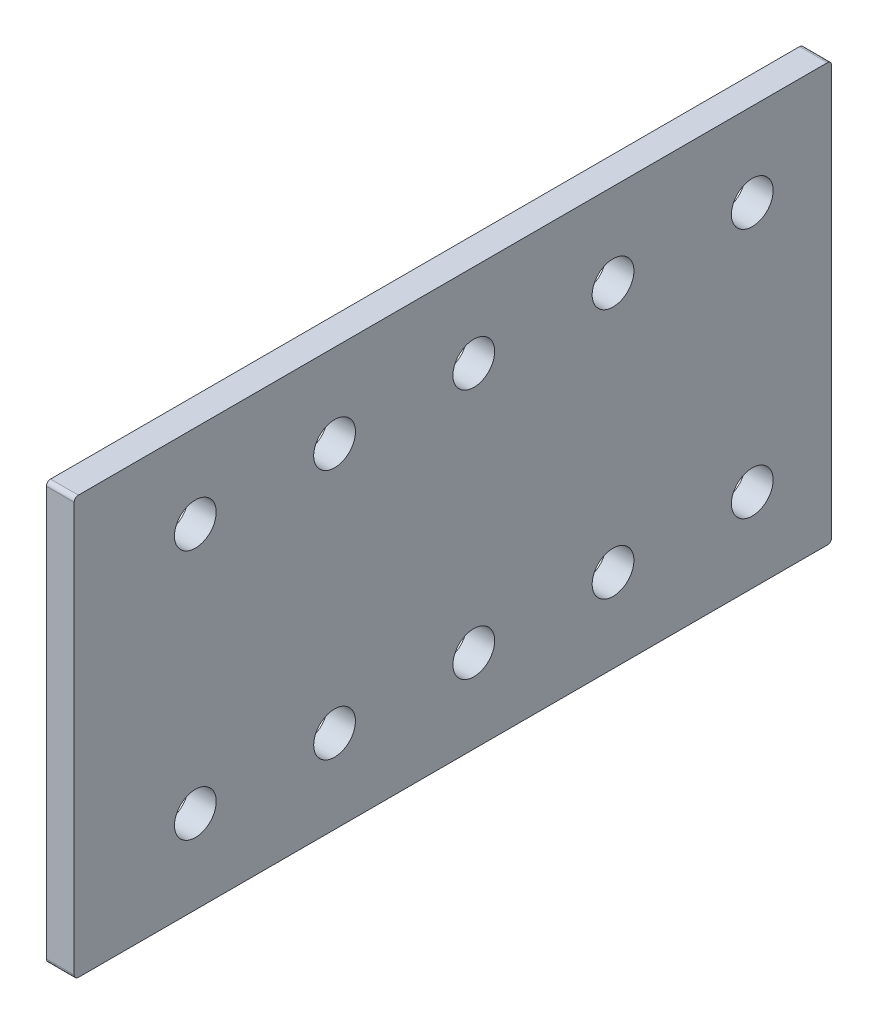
ISO-10303-21;
HEADER;
FILE_DESCRIPTION(('STEP AP214'),'2;1');
FILE_NAME('part.step','',(''),(''),'','','');
FILE_SCHEMA(('AUTOMOTIVE_DESIGN { 1 0 10303 214 1 1 1 1 }'));
ENDSEC;
DATA;
#1=APPLICATION_CONTEXT('core data for automotive mechanical design processes');
#2=APPLICATION_PROTOCOL_DEFINITION('international standard','automotive_design',2000,#1);
#3=PRODUCT_CONTEXT('',#1,'mechanical');
#4=PRODUCT('Part','Part','',(#3));
#5=PRODUCT_RELATED_PRODUCT_CATEGORY('part','',(#4));
#6=PRODUCT_DEFINITION_FORMATION('','',#4);
#7=PRODUCT_DEFINITION_CONTEXT('part definition',#1,'design');
#8=PRODUCT_DEFINITION('design','',#6,#7);
#9=PRODUCT_DEFINITION_SHAPE('','',#8);
#10=(LENGTH_UNIT() NAMED_UNIT(*) SI_UNIT(.MILLI.,.METRE.));
#11=(NAMED_UNIT(*) PLANE_ANGLE_UNIT() SI_UNIT($,.RADIAN.));
#12=(NAMED_UNIT(*) SI_UNIT($,.STERADIAN.) SOLID_ANGLE_UNIT());
#13=UNCERTAINTY_MEASURE_WITH_UNIT(LENGTH_MEASURE(1.E-05),#10,'distance_accuracy_value','');
#14=(GEOMETRIC_REPRESENTATION_CONTEXT(3) GLOBAL_UNCERTAINTY_ASSIGNED_CONTEXT((#13)) GLOBAL_UNIT_ASSIGNED_CONTEXT((#10,
#11,#12)) REPRESENTATION_CONTEXT('',''));
#15=CARTESIAN_POINT('',(0.,0.,0.));
#16=DIRECTION('',(0.,0.,1.));
#17=DIRECTION('',(1.,0.,0.));
#18=AXIS2_PLACEMENT_3D('',#15,#16,#17);
#19=CARTESIAN_POINT('',(-20.,0.,0.));
#20=DIRECTION('',(1.,0.,0.));
#21=DIRECTION('',(0.,0.,-1.));
#22=AXIS2_PLACEMENT_3D('',#19,#20,#21);
#23=PLANE('',#22);
#24=DIRECTION('',(0.,1.,0.));
#25=VECTOR('',#24,1.);
#26=CARTESIAN_POINT('',(-20.,-150.,281.000000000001));
#27=LINE('',#26,#25);
#28=CARTESIAN_POINT('',(-20.,-147.,281.000000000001));
#29=VERTEX_POINT('',#28);
#30=CARTESIAN_POINT('',(-20.,147.,281.000000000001));
#31=VERTEX_POINT('',#30);
#32=EDGE_CURVE('E174',#29,#31,#27,.T.);
#33=ORIENTED_EDGE('',*,*,#32,.T.);
#34=CARTESIAN_POINT('',(-20.,147.,278.));
#35=DIRECTION('',(1.,0.,0.));
#36=DIRECTION('',(0.,0.,-1.));
#37=AXIS2_PLACEMENT_3D('',#34,#35,#36);
#38=CIRCLE('',#37,3.);
#39=CARTESIAN_POINT('',(-20.,150.,278.));
#40=VERTEX_POINT('',#39);
#41=EDGE_CURVE('E151',#31,#40,#38,.F.);
#42=ORIENTED_EDGE('',*,*,#41,.T.);
#43=DIRECTION('',(0.,0.,-1.));
#44=VECTOR('',#43,1.);
#45=CARTESIAN_POINT('',(-20.,150.,-262.999999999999));
#46=LINE('',#45,#44);
#47=CARTESIAN_POINT('',(-20.,150.,-260.));
#48=VERTEX_POINT('',#47);
#49=EDGE_CURVE('E122',#40,#48,#46,.T.);
#50=ORIENTED_EDGE('',*,*,#49,.T.);
#51=CARTESIAN_POINT('',(-20.,147.,-260.));
#52=DIRECTION('',(1.,0.,0.));
#53=DIRECTION('',(0.,0.,-1.));
#54=AXIS2_PLACEMENT_3D('',#51,#52,#53);
#55=CIRCLE('',#54,3.);
#56=CARTESIAN_POINT('',(-20.,147.,-262.999999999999));
#57=VERTEX_POINT('',#56);
#58=EDGE_CURVE('E146',#48,#57,#55,.F.);
#59=ORIENTED_EDGE('',*,*,#58,.T.);
#60=DIRECTION('',(0.,-1.,0.));
#61=VECTOR('',#60,1.);
#62=CARTESIAN_POINT('',(-20.,-150.,-263.));
#63=LINE('',#62,#61);
#64=CARTESIAN_POINT('',(-20.,-147.,-263.));
#65=VERTEX_POINT('',#64);
#66=EDGE_CURVE('E129',#57,#65,#63,.T.);
#67=ORIENTED_EDGE('',*,*,#66,.T.);
#68=CARTESIAN_POINT('',(-20.,-147.,-260.));
#69=DIRECTION('',(1.,0.,0.));
#70=DIRECTION('',(0.,0.,-1.));
#71=AXIS2_PLACEMENT_3D('',#68,#69,#70);
#72=CIRCLE('',#71,3.);
#73=CARTESIAN_POINT('',(-20.,-150.,-260.));
#74=VERTEX_POINT('',#73);
#75=EDGE_CURVE('E58',#65,#74,#72,.F.);
#76=ORIENTED_EDGE('',*,*,#75,.T.);
#77=DIRECTION('',(0.,0.,1.));
#78=VECTOR('',#77,1.);
#79=CARTESIAN_POINT('',(-20.,-150.,-263.));
#80=LINE('',#79,#78);
#81=CARTESIAN_POINT('',(-20.,-150.,278.));
#82=VERTEX_POINT('',#81);
#83=EDGE_CURVE('E132',#74,#82,#80,.T.);
#84=ORIENTED_EDGE('',*,*,#83,.T.);
#85=CARTESIAN_POINT('',(-20.,-147.,278.));
#86=DIRECTION('',(1.,0.,0.));
#87=DIRECTION('',(0.,0.,-1.));
#88=AXIS2_PLACEMENT_3D('',#85,#86,#87);
#89=CIRCLE('',#88,3.);
#90=EDGE_CURVE('E149',#82,#29,#89,.F.);
#91=ORIENTED_EDGE('',*,*,#90,.T.);
#92=EDGE_LOOP('',(#33,#42,#50,#59,#67,#76,#84,#91));
#93=FACE_BOUND('',#92,.T.);
#94=CARTESIAN_POINT('',(-20.,-90.0000000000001,-106.));
#95=DIRECTION('',(-1.,0.,0.));
#96=DIRECTION('',(0.,0.,1.));
#97=AXIS2_PLACEMENT_3D('',#94,#95,#96);
#98=CIRCLE('',#97,15.);
#99=CARTESIAN_POINT('',(-20.,-90.0000000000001,-90.9999999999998));
#100=VERTEX_POINT('',#99);
#101=EDGE_CURVE('E167',#100,#100,#98,.T.);
#102=ORIENTED_EDGE('',*,*,#101,.F.);
#103=EDGE_LOOP('',(#102));
#104=FACE_BOUND('',#103,.T.);
#105=CARTESIAN_POINT('',(-20.,90.,-105.999999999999));
#106=DIRECTION('',(-1.,0.,0.));
#107=DIRECTION('',(0.,0.,-1.));
#108=AXIS2_PLACEMENT_3D('',#105,#106,#107);
#109=CIRCLE('',#108,15.);
#110=CARTESIAN_POINT('',(-20.,90.,-120.999999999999));
#111=VERTEX_POINT('',#110);
#112=EDGE_CURVE('E179',#111,#111,#109,.T.);
#113=ORIENTED_EDGE('',*,*,#112,.F.);
#114=EDGE_LOOP('',(#113));
#115=FACE_BOUND('',#114,.T.);
#116=CARTESIAN_POINT('',(-20.,-90.0000000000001,-206.));
#117=DIRECTION('',(-1.,0.,0.));
#118=DIRECTION('',(0.,0.,1.));
#119=AXIS2_PLACEMENT_3D('',#116,#117,#118);
#120=CIRCLE('',#119,15.);
#121=CARTESIAN_POINT('',(-20.,-90.0000000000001,-191.));
#122=VERTEX_POINT('',#121);
#123=EDGE_CURVE('E184',#122,#122,#120,.T.);
#124=ORIENTED_EDGE('',*,*,#123,.F.);
#125=EDGE_LOOP('',(#124));
#126=FACE_BOUND('',#125,.T.);
#127=CARTESIAN_POINT('',(-20.,-90.0000000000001,-5.99999999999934));
#128=DIRECTION('',(-1.,0.,0.));
#129=DIRECTION('',(0.,0.,1.));
#130=AXIS2_PLACEMENT_3D('',#127,#128,#129);
#131=CIRCLE('',#130,15.);
#132=CARTESIAN_POINT('',(-20.,-90.0000000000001,9.00000000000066));
#133=VERTEX_POINT('',#132);
#134=EDGE_CURVE('E190',#133,#133,#131,.T.);
#135=ORIENTED_EDGE('',*,*,#134,.F.);
#136=EDGE_LOOP('',(#135));
#137=FACE_BOUND('',#136,.T.);
#138=CARTESIAN_POINT('',(-20.,90.,-206.));
#139=DIRECTION('',(-1.,0.,0.));
#140=DIRECTION('',(0.,0.,-1.));
#141=AXIS2_PLACEMENT_3D('',#138,#139,#140);
#142=CIRCLE('',#141,15.);
#143=CARTESIAN_POINT('',(-20.,90.,-221.));
#144=VERTEX_POINT('',#143);
#145=EDGE_CURVE('E196',#144,#144,#142,.T.);
#146=ORIENTED_EDGE('',*,*,#145,.F.);
#147=EDGE_LOOP('',(#146));
#148=FACE_BOUND('',#147,.T.);
#149=CARTESIAN_POINT('',(-20.,-90.,194.));
#150=DIRECTION('',(-1.,0.,0.));
#151=DIRECTION('',(0.,0.,1.));
#152=AXIS2_PLACEMENT_3D('',#149,#150,#151);
#153=CIRCLE('',#152,15.);
#154=CARTESIAN_POINT('',(-20.,-90.,209.));
#155=VERTEX_POINT('',#154);
#156=EDGE_CURVE('E202',#155,#155,#153,.T.);
#157=ORIENTED_EDGE('',*,*,#156,.F.);
#158=EDGE_LOOP('',(#157));
#159=FACE_BOUND('',#158,.T.);
#160=CARTESIAN_POINT('',(-20.,-90.0000000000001,94.0000000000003));
#161=DIRECTION('',(-1.,0.,0.));
#162=DIRECTION('',(0.,0.,1.));
#163=AXIS2_PLACEMENT_3D('',#160,#161,#162);
#164=CIRCLE('',#163,15.);
#165=CARTESIAN_POINT('',(-20.,-90.0000000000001,109.));
#166=VERTEX_POINT('',#165);
#167=EDGE_CURVE('E208',#166,#166,#164,.T.);
#168=ORIENTED_EDGE('',*,*,#167,.F.);
#169=EDGE_LOOP('',(#168));
#170=FACE_BOUND('',#169,.T.);
#171=CARTESIAN_POINT('',(-20.,90.,94.0000000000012));
#172=DIRECTION('',(-1.,0.,0.));
#173=DIRECTION('',(0.,0.,-1.));
#174=AXIS2_PLACEMENT_3D('',#171,#172,#173);
#175=CIRCLE('',#174,15.);
#176=CARTESIAN_POINT('',(-20.,90.,79.0000000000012));
#177=VERTEX_POINT('',#176);
#178=EDGE_CURVE('E214',#177,#177,#175,.T.);
#179=ORIENTED_EDGE('',*,*,#178,.F.);
#180=EDGE_LOOP('',(#179));
#181=FACE_BOUND('',#180,.T.);
#182=CARTESIAN_POINT('',(-20.,90.,194.000000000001));
#183=DIRECTION('',(-1.,0.,0.));
#184=DIRECTION('',(0.,0.,-1.));
#185=AXIS2_PLACEMENT_3D('',#182,#183,#184);
#186=CIRCLE('',#185,15.);
#187=CARTESIAN_POINT('',(-20.,90.,179.000000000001));
#188=VERTEX_POINT('',#187);
#189=EDGE_CURVE('E220',#188,#188,#186,.T.);
#190=ORIENTED_EDGE('',*,*,#189,.F.);
#191=EDGE_LOOP('',(#190));
#192=FACE_BOUND('',#191,.T.);
#193=CARTESIAN_POINT('',(-20.,90.,-5.99999999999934));
#194=DIRECTION('',(-1.,0.,0.));
#195=DIRECTION('',(0.,0.,-1.));
#196=AXIS2_PLACEMENT_3D('',#193,#194,#195);
#197=CIRCLE('',#196,15.);
#198=CARTESIAN_POINT('',(-20.,90.,-20.9999999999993));
#199=VERTEX_POINT('',#198);
#200=EDGE_CURVE('E226',#199,#199,#197,.T.);
#201=ORIENTED_EDGE('',*,*,#200,.F.);
#202=EDGE_LOOP('',(#201));
#203=FACE_BOUND('',#202,.T.);
#204=ADVANCED_FACE('F36',(#93,#104,#115,#126,#137,#148,#159,#170,#181,#192,#203),#23,.F.);
#205=CARTESIAN_POINT('',(0.,0.,0.));
#206=DIRECTION('',(1.,0.,0.));
#207=DIRECTION('',(0.,0.,-1.));
#208=AXIS2_PLACEMENT_3D('',#205,#206,#207);
#209=PLANE('',#208);
#210=CARTESIAN_POINT('',(0.,90.,194.000000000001));
#211=DIRECTION('',(-1.,0.,0.));
#212=DIRECTION('',(0.,0.,-1.));
#213=AXIS2_PLACEMENT_3D('',#210,#211,#212);
#214=CIRCLE('',#213,15.);
#215=CARTESIAN_POINT('',(0.,90.,179.000000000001));
#216=VERTEX_POINT('',#215);
#217=EDGE_CURVE('E223',#216,#216,#214,.T.);
#218=ORIENTED_EDGE('',*,*,#217,.T.);
#219=EDGE_LOOP('',(#218));
#220=FACE_BOUND('',#219,.T.);
#221=CARTESIAN_POINT('',(0.,-90.0000000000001,94.0000000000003));
#222=DIRECTION('',(-1.,0.,0.));
#223=DIRECTION('',(0.,0.,1.));
#224=AXIS2_PLACEMENT_3D('',#221,#222,#223);
#225=CIRCLE('',#224,15.);
#226=CARTESIAN_POINT('',(0.,-90.0000000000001,109.));
#227=VERTEX_POINT('',#226);
#228=EDGE_CURVE('E211',#227,#227,#225,.T.);
#229=ORIENTED_EDGE('',*,*,#228,.T.);
#230=EDGE_LOOP('',(#229));
#231=FACE_BOUND('',#230,.T.);
#232=CARTESIAN_POINT('',(0.,90.,-206.));
#233=DIRECTION('',(-1.,0.,0.));
#234=DIRECTION('',(0.,0.,-1.));
#235=AXIS2_PLACEMENT_3D('',#232,#233,#234);
#236=CIRCLE('',#235,15.);
#237=CARTESIAN_POINT('',(0.,90.,-221.));
#238=VERTEX_POINT('',#237);
#239=EDGE_CURVE('E199',#238,#238,#236,.T.);
#240=ORIENTED_EDGE('',*,*,#239,.T.);
#241=EDGE_LOOP('',(#240));
#242=FACE_BOUND('',#241,.T.);
#243=CARTESIAN_POINT('',(0.,-90.0000000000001,-206.));
#244=DIRECTION('',(-1.,0.,0.));
#245=DIRECTION('',(0.,0.,1.));
#246=AXIS2_PLACEMENT_3D('',#243,#244,#245);
#247=CIRCLE('',#246,15.);
#248=CARTESIAN_POINT('',(0.,-90.0000000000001,-191.));
#249=VERTEX_POINT('',#248);
#250=EDGE_CURVE('E187',#249,#249,#247,.T.);
#251=ORIENTED_EDGE('',*,*,#250,.T.);
#252=EDGE_LOOP('',(#251));
#253=FACE_BOUND('',#252,.T.);
#254=CARTESIAN_POINT('',(0.,-90.0000000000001,-106.));
#255=DIRECTION('',(-1.,0.,0.));
#256=DIRECTION('',(0.,0.,1.));
#257=AXIS2_PLACEMENT_3D('',#254,#255,#256);
#258=CIRCLE('',#257,15.);
#259=CARTESIAN_POINT('',(0.,-90.0000000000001,-90.9999999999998));
#260=VERTEX_POINT('',#259);
#261=EDGE_CURVE('E170',#260,#260,#258,.T.);
#262=ORIENTED_EDGE('',*,*,#261,.T.);
#263=EDGE_LOOP('',(#262));
#264=FACE_BOUND('',#263,.T.);
#265=DIRECTION('',(0.,0.,-1.));
#266=VECTOR('',#265,1.);
#267=CARTESIAN_POINT('',(0.,150.,-262.999999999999));
#268=LINE('',#267,#266);
#269=CARTESIAN_POINT('',(0.,150.,278.));
#270=VERTEX_POINT('',#269);
#271=CARTESIAN_POINT('',(0.,150.,-260.));
#272=VERTEX_POINT('',#271);
#273=EDGE_CURVE('E119',#270,#272,#268,.T.);
#274=ORIENTED_EDGE('',*,*,#273,.F.);
#275=CARTESIAN_POINT('',(0.,147.,278.));
#276=DIRECTION('',(1.,0.,0.));
#277=DIRECTION('',(0.,0.,-1.));
#278=AXIS2_PLACEMENT_3D('',#275,#276,#277);
#279=CIRCLE('',#278,3.);
#280=CARTESIAN_POINT('',(0.,147.,281.000000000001));
#281=VERTEX_POINT('',#280);
#282=EDGE_CURVE('E102',#270,#281,#279,.T.);
#283=ORIENTED_EDGE('',*,*,#282,.T.);
#284=DIRECTION('',(0.,1.,0.));
#285=VECTOR('',#284,1.);
#286=CARTESIAN_POINT('',(0.,-150.,281.000000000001));
#287=LINE('',#286,#285);
#288=CARTESIAN_POINT('',(0.,-147.,281.000000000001));
#289=VERTEX_POINT('',#288);
#290=EDGE_CURVE('E130',#289,#281,#287,.T.);
#291=ORIENTED_EDGE('',*,*,#290,.F.);
#292=CARTESIAN_POINT('',(0.,-147.,278.));
#293=DIRECTION('',(1.,0.,0.));
#294=DIRECTION('',(0.,0.,-1.));
#295=AXIS2_PLACEMENT_3D('',#292,#293,#294);
#296=CIRCLE('',#295,3.);
#297=CARTESIAN_POINT('',(0.,-150.,278.));
#298=VERTEX_POINT('',#297);
#299=EDGE_CURVE('E113',#289,#298,#296,.T.);
#300=ORIENTED_EDGE('',*,*,#299,.T.);
#301=DIRECTION('',(0.,0.,1.));
#302=VECTOR('',#301,1.);
#303=CARTESIAN_POINT('',(0.,-150.,-263.));
#304=LINE('',#303,#302);
#305=CARTESIAN_POINT('',(0.,-150.,-260.));
#306=VERTEX_POINT('',#305);
#307=EDGE_CURVE('E134',#306,#298,#304,.T.);
#308=ORIENTED_EDGE('',*,*,#307,.F.);
#309=CARTESIAN_POINT('',(0.,-147.,-260.));
#310=DIRECTION('',(1.,0.,0.));
#311=DIRECTION('',(0.,0.,-1.));
#312=AXIS2_PLACEMENT_3D('',#309,#310,#311);
#313=CIRCLE('',#312,3.);
#314=CARTESIAN_POINT('',(0.,-147.,-263.));
#315=VERTEX_POINT('',#314);
#316=EDGE_CURVE('E140',#306,#315,#313,.T.);
#317=ORIENTED_EDGE('',*,*,#316,.T.);
#318=DIRECTION('',(0.,-1.,0.));
#319=VECTOR('',#318,1.);
#320=CARTESIAN_POINT('',(0.,-150.,-263.));
#321=LINE('',#320,#319);
#322=CARTESIAN_POINT('',(0.,147.,-262.999999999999));
#323=VERTEX_POINT('',#322);
#324=EDGE_CURVE('E162',#323,#315,#321,.T.);
#325=ORIENTED_EDGE('',*,*,#324,.F.);
#326=CARTESIAN_POINT('',(0.,147.,-260.));
#327=DIRECTION('',(1.,0.,0.));
#328=DIRECTION('',(0.,0.,-1.));
#329=AXIS2_PLACEMENT_3D('',#326,#327,#328);
#330=CIRCLE('',#329,3.);
#331=EDGE_CURVE('E123',#323,#272,#330,.T.);
#332=ORIENTED_EDGE('',*,*,#331,.T.);
#333=EDGE_LOOP('',(#274,#283,#291,#300,#308,#317,#325,#332));
#334=FACE_BOUND('',#333,.T.);
#335=CARTESIAN_POINT('',(0.,90.,-105.999999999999));
#336=DIRECTION('',(-1.,0.,0.));
#337=DIRECTION('',(0.,0.,-1.));
#338=AXIS2_PLACEMENT_3D('',#335,#336,#337);
#339=CIRCLE('',#338,15.);
#340=CARTESIAN_POINT('',(0.,90.,-120.999999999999));
#341=VERTEX_POINT('',#340);
#342=EDGE_CURVE('E181',#341,#341,#339,.T.);
#343=ORIENTED_EDGE('',*,*,#342,.T.);
#344=EDGE_LOOP('',(#343));
#345=FACE_BOUND('',#344,.T.);
#346=CARTESIAN_POINT('',(0.,-90.0000000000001,-5.99999999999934));
#347=DIRECTION('',(-1.,0.,0.));
#348=DIRECTION('',(0.,0.,1.));
#349=AXIS2_PLACEMENT_3D('',#346,#347,#348);
#350=CIRCLE('',#349,15.);
#351=CARTESIAN_POINT('',(0.,-90.0000000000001,9.00000000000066));
#352=VERTEX_POINT('',#351);
#353=EDGE_CURVE('E193',#352,#352,#350,.T.);
#354=ORIENTED_EDGE('',*,*,#353,.T.);
#355=EDGE_LOOP('',(#354));
#356=FACE_BOUND('',#355,.T.);
#357=CARTESIAN_POINT('',(0.,-90.0000000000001,194.));
#358=DIRECTION('',(-1.,0.,0.));
#359=DIRECTION('',(0.,0.,1.));
#360=AXIS2_PLACEMENT_3D('',#357,#358,#359);
#361=CIRCLE('',#360,15.);
#362=CARTESIAN_POINT('',(0.,-90.0000000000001,209.));
#363=VERTEX_POINT('',#362);
#364=EDGE_CURVE('E205',#363,#363,#361,.T.);
#365=ORIENTED_EDGE('',*,*,#364,.T.);
#366=EDGE_LOOP('',(#365));
#367=FACE_BOUND('',#366,.T.);
#368=CARTESIAN_POINT('',(0.,90.,94.0000000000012));
#369=DIRECTION('',(-1.,0.,0.));
#370=DIRECTION('',(0.,0.,-1.));
#371=AXIS2_PLACEMENT_3D('',#368,#369,#370);
#372=CIRCLE('',#371,15.);
#373=CARTESIAN_POINT('',(0.,90.,79.0000000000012));
#374=VERTEX_POINT('',#373);
#375=EDGE_CURVE('E217',#374,#374,#372,.T.);
#376=ORIENTED_EDGE('',*,*,#375,.T.);
#377=EDGE_LOOP('',(#376));
#378=FACE_BOUND('',#377,.T.);
#379=CARTESIAN_POINT('',(0.,90.,-5.99999999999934));
#380=DIRECTION('',(-1.,0.,0.));
#381=DIRECTION('',(0.,0.,-1.));
#382=AXIS2_PLACEMENT_3D('',#379,#380,#381);
#383=CIRCLE('',#382,15.);
#384=CARTESIAN_POINT('',(0.,90.,-20.9999999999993));
#385=VERTEX_POINT('',#384);
#386=EDGE_CURVE('E229',#385,#385,#383,.T.);
#387=ORIENTED_EDGE('',*,*,#386,.T.);
#388=EDGE_LOOP('',(#387));
#389=FACE_BOUND('',#388,.T.);
#390=ADVANCED_FACE('F126',(#220,#231,#242,#253,#264,#334,#345,#356,#367,#378,#389),#209,.T.);
#391=CARTESIAN_POINT('',(-20.,-150.,-263.));
#392=DIRECTION('',(0.,0.,1.));
#393=DIRECTION('',(0.,-1.,0.));
#394=AXIS2_PLACEMENT_3D('',#391,#392,#393);
#395=PLANE('',#394);
#396=ORIENTED_EDGE('',*,*,#324,.T.);
#397=DIRECTION('',(1.,0.,0.));
#398=VECTOR('',#397,1.);
#399=CARTESIAN_POINT('',(-20.,-147.,-263.));
#400=LINE('',#399,#398);
#401=EDGE_CURVE('E11',#315,#65,#400,.F.);
#402=ORIENTED_EDGE('',*,*,#401,.T.);
#403=ORIENTED_EDGE('',*,*,#66,.F.);
#404=DIRECTION('',(1.,0.,0.));
#405=VECTOR('',#404,1.);
#406=CARTESIAN_POINT('',(-20.,147.,-262.999999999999));
#407=LINE('',#406,#405);
#408=EDGE_CURVE('E44',#57,#323,#407,.T.);
#409=ORIENTED_EDGE('',*,*,#408,.T.);
#410=EDGE_LOOP('',(#396,#402,#403,#409));
#411=FACE_BOUND('',#410,.T.);
#412=ADVANCED_FACE('F161',(#411),#395,.F.);
#413=CARTESIAN_POINT('',(-20.,-150.,-263.));
#414=DIRECTION('',(0.,1.,0.));
#415=DIRECTION('',(0.,0.,1.));
#416=AXIS2_PLACEMENT_3D('',#413,#414,#415);
#417=PLANE('',#416);
#418=ORIENTED_EDGE('',*,*,#307,.T.);
#419=DIRECTION('',(1.,0.,0.));
#420=VECTOR('',#419,1.);
#421=CARTESIAN_POINT('',(-20.,-150.,278.));
#422=LINE('',#421,#420);
#423=EDGE_CURVE('E51',#298,#82,#422,.F.);
#424=ORIENTED_EDGE('',*,*,#423,.T.);
#425=ORIENTED_EDGE('',*,*,#83,.F.);
#426=DIRECTION('',(1.,0.,0.));
#427=VECTOR('',#426,1.);
#428=CARTESIAN_POINT('',(-20.,-150.,-260.));
#429=LINE('',#428,#427);
#430=EDGE_CURVE('E153',#74,#306,#429,.T.);
#431=ORIENTED_EDGE('',*,*,#430,.T.);
#432=EDGE_LOOP('',(#418,#424,#425,#431));
#433=FACE_BOUND('',#432,.T.);
#434=ADVANCED_FACE('F255',(#433),#417,.F.);
#435=CARTESIAN_POINT('',(-20.,-150.,281.000000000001));
#436=DIRECTION('',(0.,0.,-1.));
#437=DIRECTION('',(0.,1.,0.));
#438=AXIS2_PLACEMENT_3D('',#435,#436,#437);
#439=PLANE('',#438);
#440=ORIENTED_EDGE('',*,*,#290,.T.);
#441=DIRECTION('',(1.,0.,0.));
#442=VECTOR('',#441,1.);
#443=CARTESIAN_POINT('',(-20.,147.,281.000000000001));
#444=LINE('',#443,#442);
#445=EDGE_CURVE('E107',#281,#31,#444,.F.);
#446=ORIENTED_EDGE('',*,*,#445,.T.);
#447=ORIENTED_EDGE('',*,*,#32,.F.);
#448=DIRECTION('',(1.,0.,0.));
#449=VECTOR('',#448,1.);
#450=CARTESIAN_POINT('',(-20.,-147.,281.000000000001));
#451=LINE('',#450,#449);
#452=EDGE_CURVE('E112',#29,#289,#451,.T.);
#453=ORIENTED_EDGE('',*,*,#452,.T.);
#454=EDGE_LOOP('',(#440,#446,#447,#453));
#455=FACE_BOUND('',#454,.T.);
#456=ADVANCED_FACE('F252',(#455),#439,.F.);
#457=CARTESIAN_POINT('',(-20.,150.,-262.999999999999));
#458=DIRECTION('',(0.,-1.,0.));
#459=DIRECTION('',(0.,0.,-1.));
#460=AXIS2_PLACEMENT_3D('',#457,#458,#459);
#461=PLANE('',#460);
#462=ORIENTED_EDGE('',*,*,#49,.F.);
#463=DIRECTION('',(1.,0.,0.));
#464=VECTOR('',#463,1.);
#465=CARTESIAN_POINT('',(-20.,150.,278.));
#466=LINE('',#465,#464);
#467=EDGE_CURVE('E106',#40,#270,#466,.T.);
#468=ORIENTED_EDGE('',*,*,#467,.T.);
#469=ORIENTED_EDGE('',*,*,#273,.T.);
#470=DIRECTION('',(1.,0.,0.));
#471=VECTOR('',#470,1.);
#472=CARTESIAN_POINT('',(-20.,150.,-260.));
#473=LINE('',#472,#471);
#474=EDGE_CURVE('E124',#272,#48,#473,.F.);
#475=ORIENTED_EDGE('',*,*,#474,.T.);
#476=EDGE_LOOP('',(#462,#468,#469,#475));
#477=FACE_BOUND('',#476,.T.);
#478=ADVANCED_FACE('F118',(#477),#461,.F.);
#479=CARTESIAN_POINT('',(-20.,-90.0000000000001,-106.));
#480=DIRECTION('',(1.,0.,0.));
#481=DIRECTION('',(0.,0.,-1.));
#482=AXIS2_PLACEMENT_3D('',#479,#480,#481);
#483=CYLINDRICAL_SURFACE('',#482,15.);
#484=ORIENTED_EDGE('',*,*,#101,.T.);
#485=EDGE_LOOP('',(#484));
#486=FACE_BOUND('',#485,.T.);
#487=ORIENTED_EDGE('',*,*,#261,.F.);
#488=EDGE_LOOP('',(#487));
#489=FACE_BOUND('',#488,.T.);
#490=ADVANCED_FACE('F247',(#486,#489),#483,.F.);
#491=CARTESIAN_POINT('',(-20.,90.,-105.999999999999));
#492=DIRECTION('',(1.,0.,0.));
#493=DIRECTION('',(0.,0.,-1.));
#494=AXIS2_PLACEMENT_3D('',#491,#492,#493);
#495=CYLINDRICAL_SURFACE('',#494,15.);
#496=ORIENTED_EDGE('',*,*,#112,.T.);
#497=EDGE_LOOP('',(#496));
#498=FACE_BOUND('',#497,.T.);
#499=ORIENTED_EDGE('',*,*,#342,.F.);
#500=EDGE_LOOP('',(#499));
#501=FACE_BOUND('',#500,.T.);
#502=ADVANCED_FACE('F350',(#498,#501),#495,.F.);
#503=CARTESIAN_POINT('',(-20.,-90.0000000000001,-206.));
#504=DIRECTION('',(1.,0.,0.));
#505=DIRECTION('',(0.,0.,-1.));
#506=AXIS2_PLACEMENT_3D('',#503,#504,#505);
#507=CYLINDRICAL_SURFACE('',#506,15.);
#508=ORIENTED_EDGE('',*,*,#123,.T.);
#509=EDGE_LOOP('',(#508));
#510=FACE_BOUND('',#509,.T.);
#511=ORIENTED_EDGE('',*,*,#250,.F.);
#512=EDGE_LOOP('',(#511));
#513=FACE_BOUND('',#512,.T.);
#514=ADVANCED_FACE('F342',(#510,#513),#507,.F.);
#515=CARTESIAN_POINT('',(-20.,-90.0000000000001,-5.99999999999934));
#516=DIRECTION('',(1.,0.,0.));
#517=DIRECTION('',(0.,0.,-1.));
#518=AXIS2_PLACEMENT_3D('',#515,#516,#517);
#519=CYLINDRICAL_SURFACE('',#518,15.);
#520=ORIENTED_EDGE('',*,*,#134,.T.);
#521=EDGE_LOOP('',(#520));
#522=FACE_BOUND('',#521,.T.);
#523=ORIENTED_EDGE('',*,*,#353,.F.);
#524=EDGE_LOOP('',(#523));
#525=FACE_BOUND('',#524,.T.);
#526=ADVANCED_FACE('F334',(#522,#525),#519,.F.);
#527=CARTESIAN_POINT('',(-20.,90.,-206.));
#528=DIRECTION('',(1.,0.,0.));
#529=DIRECTION('',(0.,0.,-1.));
#530=AXIS2_PLACEMENT_3D('',#527,#528,#529);
#531=CYLINDRICAL_SURFACE('',#530,15.);
#532=ORIENTED_EDGE('',*,*,#145,.T.);
#533=EDGE_LOOP('',(#532));
#534=FACE_BOUND('',#533,.T.);
#535=ORIENTED_EDGE('',*,*,#239,.F.);
#536=EDGE_LOOP('',(#535));
#537=FACE_BOUND('',#536,.T.);
#538=ADVANCED_FACE('F326',(#534,#537),#531,.F.);
#539=CARTESIAN_POINT('',(-20.,-90.,194.));
#540=DIRECTION('',(1.,0.,0.));
#541=DIRECTION('',(0.,0.,-1.));
#542=AXIS2_PLACEMENT_3D('',#539,#540,#541);
#543=CYLINDRICAL_SURFACE('',#542,15.);
#544=ORIENTED_EDGE('',*,*,#156,.T.);
#545=EDGE_LOOP('',(#544));
#546=FACE_BOUND('',#545,.T.);
#547=ORIENTED_EDGE('',*,*,#364,.F.);
#548=EDGE_LOOP('',(#547));
#549=FACE_BOUND('',#548,.T.);
#550=ADVANCED_FACE('F318',(#546,#549),#543,.F.);
#551=CARTESIAN_POINT('',(-20.,-90.0000000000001,94.0000000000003));
#552=DIRECTION('',(1.,0.,0.));
#553=DIRECTION('',(0.,0.,-1.));
#554=AXIS2_PLACEMENT_3D('',#551,#552,#553);
#555=CYLINDRICAL_SURFACE('',#554,15.);
#556=ORIENTED_EDGE('',*,*,#167,.T.);
#557=EDGE_LOOP('',(#556));
#558=FACE_BOUND('',#557,.T.);
#559=ORIENTED_EDGE('',*,*,#228,.F.);
#560=EDGE_LOOP('',(#559));
#561=FACE_BOUND('',#560,.T.);
#562=ADVANCED_FACE('F310',(#558,#561),#555,.F.);
#563=CARTESIAN_POINT('',(-20.,90.,94.0000000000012));
#564=DIRECTION('',(1.,0.,0.));
#565=DIRECTION('',(0.,0.,-1.));
#566=AXIS2_PLACEMENT_3D('',#563,#564,#565);
#567=CYLINDRICAL_SURFACE('',#566,15.);
#568=ORIENTED_EDGE('',*,*,#178,.T.);
#569=EDGE_LOOP('',(#568));
#570=FACE_BOUND('',#569,.T.);
#571=ORIENTED_EDGE('',*,*,#375,.F.);
#572=EDGE_LOOP('',(#571));
#573=FACE_BOUND('',#572,.T.);
#574=ADVANCED_FACE('F302',(#570,#573),#567,.F.);
#575=CARTESIAN_POINT('',(-20.,90.,194.000000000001));
#576=DIRECTION('',(1.,0.,0.));
#577=DIRECTION('',(0.,0.,-1.));
#578=AXIS2_PLACEMENT_3D('',#575,#576,#577);
#579=CYLINDRICAL_SURFACE('',#578,15.);
#580=ORIENTED_EDGE('',*,*,#189,.T.);
#581=EDGE_LOOP('',(#580));
#582=FACE_BOUND('',#581,.T.);
#583=ORIENTED_EDGE('',*,*,#217,.F.);
#584=EDGE_LOOP('',(#583));
#585=FACE_BOUND('',#584,.T.);
#586=ADVANCED_FACE('F295',(#582,#585),#579,.F.);
#587=CARTESIAN_POINT('',(-20.,90.,-5.99999999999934));
#588=DIRECTION('',(1.,0.,0.));
#589=DIRECTION('',(0.,0.,-1.));
#590=AXIS2_PLACEMENT_3D('',#587,#588,#589);
#591=CYLINDRICAL_SURFACE('',#590,15.);
#592=ORIENTED_EDGE('',*,*,#200,.T.);
#593=EDGE_LOOP('',(#592));
#594=FACE_BOUND('',#593,.T.);
#595=ORIENTED_EDGE('',*,*,#386,.F.);
#596=EDGE_LOOP('',(#595));
#597=FACE_BOUND('',#596,.T.);
#598=ADVANCED_FACE('F235',(#594,#597),#591,.F.);
#599=CARTESIAN_POINT('',(-20.,147.,278.));
#600=DIRECTION('',(1.,0.,0.));
#601=DIRECTION('',(0.,0.,-1.));
#602=AXIS2_PLACEMENT_3D('',#599,#600,#601);
#603=CYLINDRICAL_SURFACE('',#602,3.);
#604=ORIENTED_EDGE('',*,*,#41,.F.);
#605=ORIENTED_EDGE('',*,*,#445,.F.);
#606=ORIENTED_EDGE('',*,*,#282,.F.);
#607=ORIENTED_EDGE('',*,*,#467,.F.);
#608=EDGE_LOOP('',(#604,#605,#606,#607));
#609=FACE_BOUND('',#608,.T.);
#610=ADVANCED_FACE('F105',(#609),#603,.T.);
#611=CARTESIAN_POINT('',(-20.,-147.,278.));
#612=DIRECTION('',(1.,0.,0.));
#613=DIRECTION('',(0.,0.,-1.));
#614=AXIS2_PLACEMENT_3D('',#611,#612,#613);
#615=CYLINDRICAL_SURFACE('',#614,3.);
#616=ORIENTED_EDGE('',*,*,#90,.F.);
#617=ORIENTED_EDGE('',*,*,#423,.F.);
#618=ORIENTED_EDGE('',*,*,#299,.F.);
#619=ORIENTED_EDGE('',*,*,#452,.F.);
#620=EDGE_LOOP('',(#616,#617,#618,#619));
#621=FACE_BOUND('',#620,.T.);
#622=ADVANCED_FACE('F263',(#621),#615,.T.);
#623=CARTESIAN_POINT('',(-20.,-147.,-260.));
#624=DIRECTION('',(1.,0.,0.));
#625=DIRECTION('',(0.,0.,-1.));
#626=AXIS2_PLACEMENT_3D('',#623,#624,#625);
#627=CYLINDRICAL_SURFACE('',#626,3.);
#628=ORIENTED_EDGE('',*,*,#75,.F.);
#629=ORIENTED_EDGE('',*,*,#401,.F.);
#630=ORIENTED_EDGE('',*,*,#316,.F.);
#631=ORIENTED_EDGE('',*,*,#430,.F.);
#632=EDGE_LOOP('',(#628,#629,#630,#631));
#633=FACE_BOUND('',#632,.T.);
#634=ADVANCED_FACE('F265',(#633),#627,.T.);
#635=CARTESIAN_POINT('',(-20.,147.,-260.));
#636=DIRECTION('',(1.,0.,0.));
#637=DIRECTION('',(0.,0.,-1.));
#638=AXIS2_PLACEMENT_3D('',#635,#636,#637);
#639=CYLINDRICAL_SURFACE('',#638,3.);
#640=ORIENTED_EDGE('',*,*,#58,.F.);
#641=ORIENTED_EDGE('',*,*,#474,.F.);
#642=ORIENTED_EDGE('',*,*,#331,.F.);
#643=ORIENTED_EDGE('',*,*,#408,.F.);
#644=EDGE_LOOP('',(#640,#641,#642,#643));
#645=FACE_BOUND('',#644,.T.);
#646=ADVANCED_FACE('F38',(#645),#639,.T.);
#647=CLOSED_SHELL('',(#204,#390,#412,#434,#456,#478,#490,#502,#514,#526,#538,#550,#562,#574,
#586,#598,#610,#622,#634,#646));
#648=MANIFOLD_SOLID_BREP('B2',#647);
#649=ADVANCED_BREP_SHAPE_REPRESENTATION('',(#18,#648),#14);
#650=SHAPE_DEFINITION_REPRESENTATION(#9,#649);
ENDSEC;
END-ISO-10303-21;
